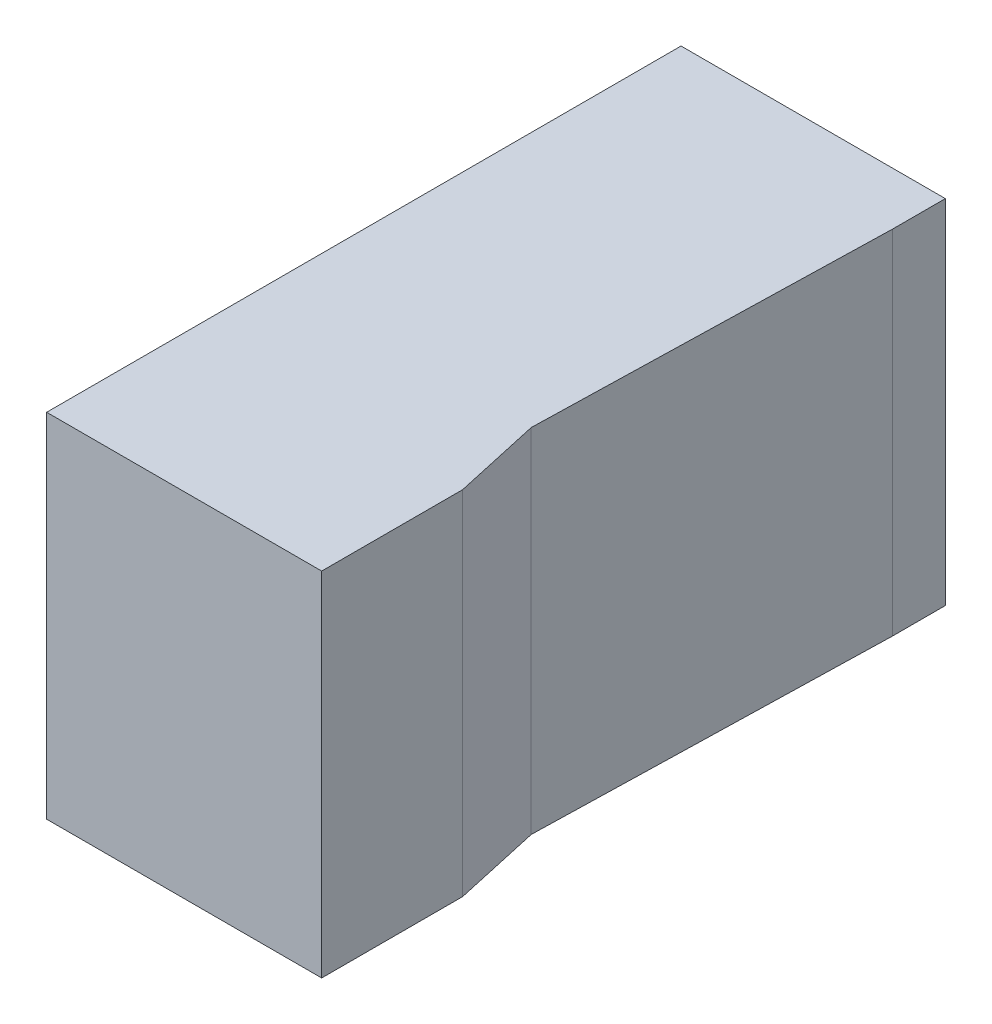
from build123d import *

# Parameters (mm, degrees)
TEIL_MIT_HINTERSCHNITT_DEPTH = 10


with BuildPart() as part:
    # Skizze2 → teil mit hinterschnitt (new, symmetric)
    with BuildSketch(Plane(origin=(0, 0, 0), x_dir=(1, 0, 0), z_dir=(0, 1, 0))):
        Polygon((-20, 20), (-20, 23), (-35, 23), (-35, -13), (-19.392272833, -13), (-19.392272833, -5), (-20.5, 0), align=None)
    extrude(amount=TEIL_MIT_HINTERSCHNITT_DEPTH, both=True)


solid = part.part
